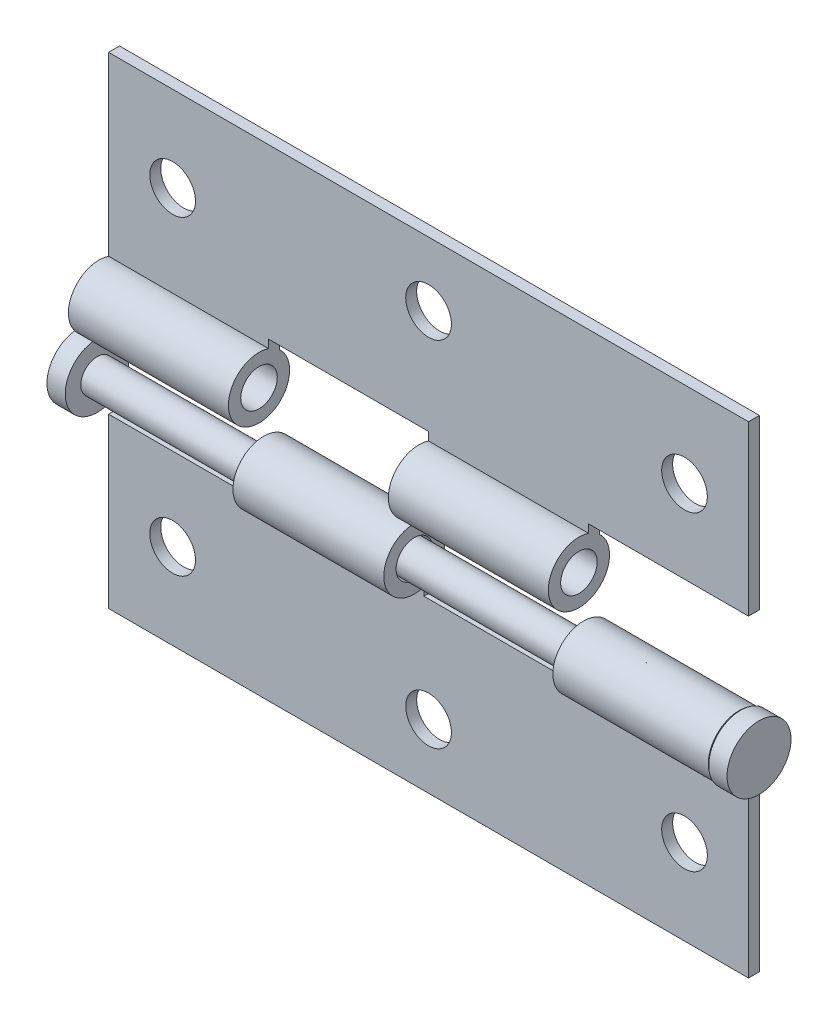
ISO-10303-21;
HEADER;
FILE_DESCRIPTION(('STEP AP214'),'2;1');
FILE_NAME('part.step','',(''),(''),'','','');
FILE_SCHEMA(('AUTOMOTIVE_DESIGN { 1 0 10303 214 1 1 1 1 }'));
ENDSEC;
DATA;
#1=APPLICATION_CONTEXT('core data for automotive mechanical design processes');
#2=APPLICATION_PROTOCOL_DEFINITION('international standard','automotive_design',2000,#1);
#3=PRODUCT_CONTEXT('',#1,'mechanical');
#4=PRODUCT('Part','Part','',(#3));
#5=PRODUCT_RELATED_PRODUCT_CATEGORY('part','',(#4));
#6=PRODUCT_DEFINITION_FORMATION('','',#4);
#7=PRODUCT_DEFINITION_CONTEXT('part definition',#1,'design');
#8=PRODUCT_DEFINITION('design','',#6,#7);
#9=PRODUCT_DEFINITION_SHAPE('','',#8);
#10=(LENGTH_UNIT() NAMED_UNIT(*) SI_UNIT(.MILLI.,.METRE.));
#11=(NAMED_UNIT(*) PLANE_ANGLE_UNIT() SI_UNIT($,.RADIAN.));
#12=(NAMED_UNIT(*) SI_UNIT($,.STERADIAN.) SOLID_ANGLE_UNIT());
#13=UNCERTAINTY_MEASURE_WITH_UNIT(LENGTH_MEASURE(1.E-05),#10,'distance_accuracy_value','');
#14=(GEOMETRIC_REPRESENTATION_CONTEXT(3) GLOBAL_UNCERTAINTY_ASSIGNED_CONTEXT((#13)) GLOBAL_UNIT_ASSIGNED_CONTEXT((#10,
#11,#12)) REPRESENTATION_CONTEXT('',''));
#15=CARTESIAN_POINT('',(0.,0.,0.));
#16=DIRECTION('',(0.,0.,1.));
#17=DIRECTION('',(1.,0.,0.));
#18=AXIS2_PLACEMENT_3D('',#15,#16,#17);
#19=CARTESIAN_POINT('',(35.,3.85,2.25));
#20=DIRECTION('',(-1.,0.,0.));
#21=DIRECTION('',(0.,0.,1.));
#22=AXIS2_PLACEMENT_3D('',#19,#20,#21);
#23=CYLINDRICAL_SURFACE('',#22,3.35);
#24=DIRECTION('',(-1.,0.,0.));
#25=VECTOR('',#24,1.);
#26=CARTESIAN_POINT('',(35.,7.03119474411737,1.2));
#27=LINE('',#26,#25);
#28=CARTESIAN_POINT('',(17.5,7.03119474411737,1.2));
#29=VERTEX_POINT('',#28);
#30=CARTESIAN_POINT('',(0.,7.03119474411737,1.2));
#31=VERTEX_POINT('',#30);
#32=EDGE_CURVE('E192',#29,#31,#27,.T.);
#33=ORIENTED_EDGE('',*,*,#32,.T.);
#34=CARTESIAN_POINT('',(0.,3.85,2.25));
#35=DIRECTION('',(1.,0.,0.));
#36=DIRECTION('',(0.,0.,-1.));
#37=AXIS2_PLACEMENT_3D('',#34,#35,#36);
#38=CIRCLE('',#37,3.35);
#39=CARTESIAN_POINT('',(0.,6.33193472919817,0.));
#40=VERTEX_POINT('',#39);
#41=EDGE_CURVE('E146',#31,#40,#38,.T.);
#42=ORIENTED_EDGE('',*,*,#41,.T.);
#43=DIRECTION('',(-1.,0.,0.));
#44=VECTOR('',#43,1.);
#45=CARTESIAN_POINT('',(35.,6.33193472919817,0.));
#46=LINE('',#45,#44);
#47=CARTESIAN_POINT('',(17.5,6.33193472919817,0.));
#48=VERTEX_POINT('',#47);
#49=EDGE_CURVE('E196',#48,#40,#46,.T.);
#50=ORIENTED_EDGE('',*,*,#49,.F.);
#51=CARTESIAN_POINT('',(17.5,3.85,2.25));
#52=DIRECTION('',(-1.,0.,0.));
#53=DIRECTION('',(0.,-1.,0.));
#54=AXIS2_PLACEMENT_3D('',#51,#52,#53);
#55=CIRCLE('',#54,3.35);
#56=EDGE_CURVE('E156',#48,#29,#55,.T.);
#57=ORIENTED_EDGE('',*,*,#56,.T.);
#58=EDGE_LOOP('',(#33,#42,#50,#57));
#59=FACE_BOUND('',#58,.T.);
#60=ADVANCED_FACE('F47',(#59),#23,.T.);
#61=CARTESIAN_POINT('',(35.,3.85,2.25));
#62=DIRECTION('',(-1.,0.,0.));
#63=DIRECTION('',(0.,0.,1.));
#64=AXIS2_PLACEMENT_3D('',#61,#62,#63);
#65=CYLINDRICAL_SURFACE('',#64,2.);
#66=CARTESIAN_POINT('',(0.,3.85,2.25));
#67=DIRECTION('',(1.,0.,0.));
#68=DIRECTION('',(0.,0.,-1.));
#69=AXIS2_PLACEMENT_3D('',#66,#67,#68);
#70=CIRCLE('',#69,2.);
#71=CARTESIAN_POINT('',(0.,3.85,0.249999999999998));
#72=VERTEX_POINT('',#71);
#73=EDGE_CURVE('E134',#72,#72,#70,.T.);
#74=ORIENTED_EDGE('',*,*,#73,.F.);
#75=EDGE_LOOP('',(#74));
#76=FACE_BOUND('',#75,.T.);
#77=CARTESIAN_POINT('',(17.5,3.85,2.25));
#78=DIRECTION('',(-1.,0.,0.));
#79=DIRECTION('',(0.,-1.,0.));
#80=AXIS2_PLACEMENT_3D('',#77,#78,#79);
#81=CIRCLE('',#80,2.);
#82=CARTESIAN_POINT('',(17.5,1.85,2.25));
#83=VERTEX_POINT('',#82);
#84=EDGE_CURVE('E151',#83,#83,#81,.T.);
#85=ORIENTED_EDGE('',*,*,#84,.F.);
#86=EDGE_LOOP('',(#85));
#87=FACE_BOUND('',#86,.T.);
#88=ADVANCED_FACE('F284',(#76,#87),#65,.F.);
#89=CARTESIAN_POINT('',(35.,3.85,2.25));
#90=DIRECTION('',(1.,0.,0.));
#91=DIRECTION('',(0.,0.,-1.));
#92=AXIS2_PLACEMENT_3D('',#89,#90,#91);
#93=PLANE('',#92);
#94=DIRECTION('',(0.,0.,1.));
#95=VECTOR('',#94,1.);
#96=CARTESIAN_POINT('',(35.,7.93119474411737,-1.25));
#97=LINE('',#96,#95);
#98=CARTESIAN_POINT('',(35.,7.93119474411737,0.));
#99=VERTEX_POINT('',#98);
#100=CARTESIAN_POINT('',(35.,7.93119474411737,1.2));
#101=VERTEX_POINT('',#100);
#102=EDGE_CURVE('E70',#99,#101,#97,.T.);
#103=ORIENTED_EDGE('',*,*,#102,.F.);
#104=DIRECTION('',(0.,-1.,0.));
#105=VECTOR('',#104,1.);
#106=CARTESIAN_POINT('',(35.,6.33193472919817,0.));
#107=LINE('',#106,#105);
#108=CARTESIAN_POINT('',(35.,26.35,0.));
#109=VERTEX_POINT('',#108);
#110=EDGE_CURVE('E168',#109,#99,#107,.T.);
#111=ORIENTED_EDGE('',*,*,#110,.F.);
#112=DIRECTION('',(0.,0.,-1.));
#113=VECTOR('',#112,1.);
#114=CARTESIAN_POINT('',(35.,26.35,1.2));
#115=LINE('',#114,#113);
#116=CARTESIAN_POINT('',(35.,26.35,1.2));
#117=VERTEX_POINT('',#116);
#118=EDGE_CURVE('E174',#117,#109,#115,.T.);
#119=ORIENTED_EDGE('',*,*,#118,.F.);
#120=DIRECTION('',(0.,1.,0.));
#121=VECTOR('',#120,1.);
#122=CARTESIAN_POINT('',(35.,7.03119474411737,1.2));
#123=LINE('',#122,#121);
#124=EDGE_CURVE('E171',#101,#117,#123,.T.);
#125=ORIENTED_EDGE('',*,*,#124,.F.);
#126=EDGE_LOOP('',(#103,#111,#119,#125));
#127=FACE_BOUND('',#126,.T.);
#128=ADVANCED_FACE('F262',(#127),#93,.T.);
#129=CARTESIAN_POINT('',(-35.,3.85,2.25));
#130=DIRECTION('',(1.,0.,0.));
#131=DIRECTION('',(0.,0.,-1.));
#132=AXIS2_PLACEMENT_3D('',#129,#130,#131);
#133=PLANE('',#132);
#134=DIRECTION('',(0.,-1.,0.));
#135=VECTOR('',#134,1.);
#136=CARTESIAN_POINT('',(-35.,6.33193472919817,0.));
#137=LINE('',#136,#135);
#138=CARTESIAN_POINT('',(-35.,26.35,0.));
#139=VERTEX_POINT('',#138);
#140=CARTESIAN_POINT('',(-35.,6.33193472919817,0.));
#141=VERTEX_POINT('',#140);
#142=EDGE_CURVE('E167',#139,#141,#137,.T.);
#143=ORIENTED_EDGE('',*,*,#142,.T.);
#144=CARTESIAN_POINT('',(-35.,3.85,2.25));
#145=DIRECTION('',(-1.,0.,0.));
#146=DIRECTION('',(0.,0.,-1.));
#147=AXIS2_PLACEMENT_3D('',#144,#145,#146);
#148=CIRCLE('',#147,3.35);
#149=CARTESIAN_POINT('',(-35.,7.03119474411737,1.2));
#150=VERTEX_POINT('',#149);
#151=EDGE_CURVE('E180',#141,#150,#148,.T.);
#152=ORIENTED_EDGE('',*,*,#151,.T.);
#153=DIRECTION('',(0.,1.,0.));
#154=VECTOR('',#153,1.);
#155=CARTESIAN_POINT('',(-35.,7.03119474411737,1.2));
#156=LINE('',#155,#154);
#157=CARTESIAN_POINT('',(-35.,26.35,1.2));
#158=VERTEX_POINT('',#157);
#159=EDGE_CURVE('E183',#150,#158,#156,.T.);
#160=ORIENTED_EDGE('',*,*,#159,.T.);
#161=DIRECTION('',(0.,0.,-1.));
#162=VECTOR('',#161,1.);
#163=CARTESIAN_POINT('',(-35.,26.35,1.2));
#164=LINE('',#163,#162);
#165=EDGE_CURVE('E172',#158,#139,#164,.T.);
#166=ORIENTED_EDGE('',*,*,#165,.T.);
#167=EDGE_LOOP('',(#143,#152,#160,#166));
#168=FACE_BOUND('',#167,.T.);
#169=CARTESIAN_POINT('',(-35.,3.85,2.25));
#170=DIRECTION('',(-1.,0.,0.));
#171=DIRECTION('',(0.,0.,-1.));
#172=AXIS2_PLACEMENT_3D('',#169,#170,#171);
#173=CIRCLE('',#172,2.);
#174=CARTESIAN_POINT('',(-35.,3.85,0.249999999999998));
#175=VERTEX_POINT('',#174);
#176=EDGE_CURVE('E164',#175,#175,#173,.T.);
#177=ORIENTED_EDGE('',*,*,#176,.F.);
#178=EDGE_LOOP('',(#177));
#179=FACE_BOUND('',#178,.T.);
#180=ADVANCED_FACE('F253',(#168,#179),#133,.F.);
#181=CARTESIAN_POINT('',(35.,6.33193472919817,0.));
#182=DIRECTION('',(0.,0.,1.));
#183=DIRECTION('',(1.,0.,0.));
#184=AXIS2_PLACEMENT_3D('',#181,#182,#183);
#185=PLANE('',#184);
#186=CARTESIAN_POINT('',(0.,19.35,0.));
#187=DIRECTION('',(0.,0.,1.));
#188=DIRECTION('',(1.,0.,0.));
#189=AXIS2_PLACEMENT_3D('',#186,#187,#188);
#190=CIRCLE('',#189,2.5);
#191=CARTESIAN_POINT('',(2.5,19.35,0.));
#192=VERTEX_POINT('',#191);
#193=EDGE_CURVE('E215',#192,#192,#190,.T.);
#194=ORIENTED_EDGE('',*,*,#193,.T.);
#195=EDGE_LOOP('',(#194));
#196=FACE_BOUND('',#195,.T.);
#197=CARTESIAN_POINT('',(28.,17.,0.));
#198=DIRECTION('',(0.,0.,1.));
#199=DIRECTION('',(1.,0.,0.));
#200=AXIS2_PLACEMENT_3D('',#197,#198,#199);
#201=CIRCLE('',#200,2.5);
#202=CARTESIAN_POINT('',(30.5,17.,0.));
#203=VERTEX_POINT('',#202);
#204=EDGE_CURVE('E219',#203,#203,#201,.T.);
#205=ORIENTED_EDGE('',*,*,#204,.T.);
#206=EDGE_LOOP('',(#205));
#207=FACE_BOUND('',#206,.T.);
#208=CARTESIAN_POINT('',(-28.,17.,0.));
#209=DIRECTION('',(0.,0.,1.));
#210=DIRECTION('',(1.,0.,0.));
#211=AXIS2_PLACEMENT_3D('',#208,#209,#210);
#212=CIRCLE('',#211,2.5);
#213=CARTESIAN_POINT('',(-25.5,17.,0.));
#214=VERTEX_POINT('',#213);
#215=EDGE_CURVE('E222',#214,#214,#212,.T.);
#216=ORIENTED_EDGE('',*,*,#215,.T.);
#217=EDGE_LOOP('',(#216));
#218=FACE_BOUND('',#217,.T.);
#219=ORIENTED_EDGE('',*,*,#49,.T.);
#220=DIRECTION('',(0.,1.,0.));
#221=VECTOR('',#220,1.);
#222=CARTESIAN_POINT('',(0.,6.33193472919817,0.));
#223=LINE('',#222,#221);
#224=CARTESIAN_POINT('',(0.,7.93119474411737,0.));
#225=VERTEX_POINT('',#224);
#226=EDGE_CURVE('E142',#40,#225,#223,.T.);
#227=ORIENTED_EDGE('',*,*,#226,.T.);
#228=DIRECTION('',(-1.,0.,0.));
#229=VECTOR('',#228,1.);
#230=CARTESIAN_POINT('',(35.,7.93119474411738,0.));
#231=LINE('',#230,#229);
#232=CARTESIAN_POINT('',(-17.5,7.93119474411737,0.));
#233=VERTEX_POINT('',#232);
#234=EDGE_CURVE('E137',#225,#233,#231,.T.);
#235=ORIENTED_EDGE('',*,*,#234,.T.);
#236=DIRECTION('',(0.,-1.,0.));
#237=VECTOR('',#236,1.);
#238=CARTESIAN_POINT('',(-17.5,6.33193472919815,0.));
#239=LINE('',#238,#237);
#240=CARTESIAN_POINT('',(-17.5,6.33193472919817,0.));
#241=VERTEX_POINT('',#240);
#242=EDGE_CURVE('E124',#233,#241,#239,.T.);
#243=ORIENTED_EDGE('',*,*,#242,.T.);
#244=EDGE_CURVE('E195',#241,#141,#46,.T.);
#245=ORIENTED_EDGE('',*,*,#244,.T.);
#246=ORIENTED_EDGE('',*,*,#142,.F.);
#247=DIRECTION('',(-1.,0.,0.));
#248=VECTOR('',#247,1.);
#249=CARTESIAN_POINT('',(35.,26.35,0.));
#250=LINE('',#249,#248);
#251=EDGE_CURVE('E177',#109,#139,#250,.T.);
#252=ORIENTED_EDGE('',*,*,#251,.F.);
#253=ORIENTED_EDGE('',*,*,#110,.T.);
#254=DIRECTION('',(-1.,0.,0.));
#255=VECTOR('',#254,1.);
#256=CARTESIAN_POINT('',(35.,7.93119474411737,0.));
#257=LINE('',#256,#255);
#258=CARTESIAN_POINT('',(17.5,7.93119474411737,0.));
#259=VERTEX_POINT('',#258);
#260=EDGE_CURVE('E161',#99,#259,#257,.T.);
#261=ORIENTED_EDGE('',*,*,#260,.T.);
#262=DIRECTION('',(0.,-1.,0.));
#263=VECTOR('',#262,1.);
#264=CARTESIAN_POINT('',(17.5,6.33193472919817,0.));
#265=LINE('',#264,#263);
#266=EDGE_CURVE('E158',#259,#48,#265,.T.);
#267=ORIENTED_EDGE('',*,*,#266,.T.);
#268=EDGE_LOOP('',(#219,#227,#235,#243,#245,#246,#252,#253,#261,#267));
#269=FACE_BOUND('',#268,.T.);
#270=ADVANCED_FACE('F49',(#196,#207,#218,#269),#185,.F.);
#271=CARTESIAN_POINT('',(-17.5,3.85,2.25));
#272=DIRECTION('',(-1.,0.,0.));
#273=DIRECTION('',(0.,-1.,0.));
#274=AXIS2_PLACEMENT_3D('',#271,#272,#273);
#275=CIRCLE('',#274,3.35);
#276=CARTESIAN_POINT('',(-17.5,7.03119474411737,1.2));
#277=VERTEX_POINT('',#276);
#278=EDGE_CURVE('E130',#241,#277,#275,.T.);
#279=ORIENTED_EDGE('',*,*,#278,.T.);
#280=EDGE_CURVE('E191',#277,#150,#27,.T.);
#281=ORIENTED_EDGE('',*,*,#280,.T.);
#282=ORIENTED_EDGE('',*,*,#151,.F.);
#283=ORIENTED_EDGE('',*,*,#244,.F.);
#284=EDGE_LOOP('',(#279,#281,#282,#283));
#285=FACE_BOUND('',#284,.T.);
#286=ADVANCED_FACE('F242',(#285),#23,.T.);
#287=CARTESIAN_POINT('',(35.,7.03119474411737,1.2));
#288=DIRECTION('',(0.,0.,-1.));
#289=DIRECTION('',(0.,-1.,0.));
#290=AXIS2_PLACEMENT_3D('',#287,#288,#289);
#291=PLANE('',#290);
#292=CARTESIAN_POINT('',(0.,19.35,1.2));
#293=DIRECTION('',(0.,0.,1.));
#294=DIRECTION('',(-1.,0.,0.));
#295=AXIS2_PLACEMENT_3D('',#292,#293,#294);
#296=CIRCLE('',#295,2.5);
#297=CARTESIAN_POINT('',(-2.5,19.35,1.2));
#298=VERTEX_POINT('',#297);
#299=EDGE_CURVE('E225',#298,#298,#296,.T.);
#300=ORIENTED_EDGE('',*,*,#299,.F.);
#301=EDGE_LOOP('',(#300));
#302=FACE_BOUND('',#301,.T.);
#303=CARTESIAN_POINT('',(28.,17.,1.2));
#304=DIRECTION('',(0.,0.,1.));
#305=DIRECTION('',(1.,0.,0.));
#306=AXIS2_PLACEMENT_3D('',#303,#304,#305);
#307=CIRCLE('',#306,2.5);
#308=CARTESIAN_POINT('',(30.5,17.,1.2));
#309=VERTEX_POINT('',#308);
#310=EDGE_CURVE('E229',#309,#309,#307,.T.);
#311=ORIENTED_EDGE('',*,*,#310,.F.);
#312=EDGE_LOOP('',(#311));
#313=FACE_BOUND('',#312,.T.);
#314=CARTESIAN_POINT('',(-28.,17.,1.2));
#315=DIRECTION('',(0.,0.,1.));
#316=DIRECTION('',(-1.,0.,0.));
#317=AXIS2_PLACEMENT_3D('',#314,#315,#316);
#318=CIRCLE('',#317,2.5);
#319=CARTESIAN_POINT('',(-30.5,17.,1.2));
#320=VERTEX_POINT('',#319);
#321=EDGE_CURVE('E226',#320,#320,#318,.T.);
#322=ORIENTED_EDGE('',*,*,#321,.F.);
#323=EDGE_LOOP('',(#322));
#324=FACE_BOUND('',#323,.T.);
#325=DIRECTION('',(1.,0.,0.));
#326=VECTOR('',#325,1.);
#327=CARTESIAN_POINT('',(35.,7.93119474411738,1.2));
#328=LINE('',#327,#326);
#329=CARTESIAN_POINT('',(-17.5,7.93119474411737,1.2));
#330=VERTEX_POINT('',#329);
#331=CARTESIAN_POINT('',(0.,7.93119474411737,1.2));
#332=VERTEX_POINT('',#331);
#333=EDGE_CURVE('E13',#330,#332,#328,.T.);
#334=ORIENTED_EDGE('',*,*,#333,.T.);
#335=DIRECTION('',(0.,-1.,0.));
#336=VECTOR('',#335,1.);
#337=CARTESIAN_POINT('',(0.,7.03119474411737,1.2));
#338=LINE('',#337,#336);
#339=EDGE_CURVE('E204',#332,#31,#338,.T.);
#340=ORIENTED_EDGE('',*,*,#339,.T.);
#341=ORIENTED_EDGE('',*,*,#32,.F.);
#342=DIRECTION('',(0.,1.,0.));
#343=VECTOR('',#342,1.);
#344=CARTESIAN_POINT('',(17.5,7.03119474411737,1.2));
#345=LINE('',#344,#343);
#346=CARTESIAN_POINT('',(17.5,7.93119474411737,1.2));
#347=VERTEX_POINT('',#346);
#348=EDGE_CURVE('E153',#29,#347,#345,.T.);
#349=ORIENTED_EDGE('',*,*,#348,.T.);
#350=DIRECTION('',(1.,0.,0.));
#351=VECTOR('',#350,1.);
#352=CARTESIAN_POINT('',(35.,7.93119474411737,1.2));
#353=LINE('',#352,#351);
#354=EDGE_CURVE('E55',#347,#101,#353,.T.);
#355=ORIENTED_EDGE('',*,*,#354,.T.);
#356=ORIENTED_EDGE('',*,*,#124,.T.);
#357=DIRECTION('',(-1.,0.,0.));
#358=VECTOR('',#357,1.);
#359=CARTESIAN_POINT('',(35.,26.35,1.2));
#360=LINE('',#359,#358);
#361=EDGE_CURVE('E189',#117,#158,#360,.T.);
#362=ORIENTED_EDGE('',*,*,#361,.T.);
#363=ORIENTED_EDGE('',*,*,#159,.F.);
#364=ORIENTED_EDGE('',*,*,#280,.F.);
#365=DIRECTION('',(0.,1.,0.));
#366=VECTOR('',#365,1.);
#367=CARTESIAN_POINT('',(-17.5,7.03119474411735,1.2));
#368=LINE('',#367,#366);
#369=EDGE_CURVE('E202',#277,#330,#368,.T.);
#370=ORIENTED_EDGE('',*,*,#369,.T.);
#371=EDGE_LOOP('',(#334,#340,#341,#349,#355,#356,#362,#363,#364,#370));
#372=FACE_BOUND('',#371,.T.);
#373=ADVANCED_FACE('F238',(#302,#313,#324,#372),#291,.F.);
#374=CARTESIAN_POINT('',(35.,26.35,1.2));
#375=DIRECTION('',(0.,-1.,0.));
#376=DIRECTION('',(0.,0.,1.));
#377=AXIS2_PLACEMENT_3D('',#374,#375,#376);
#378=PLANE('',#377);
#379=ORIENTED_EDGE('',*,*,#165,.F.);
#380=ORIENTED_EDGE('',*,*,#361,.F.);
#381=ORIENTED_EDGE('',*,*,#118,.T.);
#382=ORIENTED_EDGE('',*,*,#251,.T.);
#383=EDGE_LOOP('',(#379,#380,#381,#382));
#384=FACE_BOUND('',#383,.T.);
#385=ADVANCED_FACE('F241',(#384),#378,.F.);
#386=CARTESIAN_POINT('',(-17.5,3.85,2.25));
#387=DIRECTION('',(-1.,0.,0.));
#388=DIRECTION('',(0.,-1.,0.));
#389=AXIS2_PLACEMENT_3D('',#386,#387,#388);
#390=CIRCLE('',#389,2.);
#391=CARTESIAN_POINT('',(-17.5,1.85,2.25));
#392=VERTEX_POINT('',#391);
#393=EDGE_CURVE('E138',#392,#392,#390,.T.);
#394=ORIENTED_EDGE('',*,*,#393,.F.);
#395=EDGE_LOOP('',(#394));
#396=FACE_BOUND('',#395,.T.);
#397=ORIENTED_EDGE('',*,*,#176,.T.);
#398=EDGE_LOOP('',(#397));
#399=FACE_BOUND('',#398,.T.);
#400=ADVANCED_FACE('F290',(#396,#399),#65,.F.);
#401=CARTESIAN_POINT('',(35.,7.93119474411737,-1.25));
#402=DIRECTION('',(0.,1.,0.));
#403=DIRECTION('',(-1.,0.,0.));
#404=AXIS2_PLACEMENT_3D('',#401,#402,#403);
#405=PLANE('',#404);
#406=ORIENTED_EDGE('',*,*,#102,.T.);
#407=ORIENTED_EDGE('',*,*,#354,.F.);
#408=DIRECTION('',(0.,0.,1.));
#409=VECTOR('',#408,1.);
#410=CARTESIAN_POINT('',(17.5,7.93119474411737,-1.25));
#411=LINE('',#410,#409);
#412=EDGE_CURVE('E144',#259,#347,#411,.T.);
#413=ORIENTED_EDGE('',*,*,#412,.F.);
#414=ORIENTED_EDGE('',*,*,#260,.F.);
#415=EDGE_LOOP('',(#406,#407,#413,#414));
#416=FACE_BOUND('',#415,.T.);
#417=ADVANCED_FACE('F265',(#416),#405,.F.);
#418=CARTESIAN_POINT('',(17.5,7.93119474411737,-1.25));
#419=DIRECTION('',(-1.,0.,0.));
#420=DIRECTION('',(0.,-1.,0.));
#421=AXIS2_PLACEMENT_3D('',#418,#419,#420);
#422=PLANE('',#421);
#423=ORIENTED_EDGE('',*,*,#84,.T.);
#424=EDGE_LOOP('',(#423));
#425=FACE_BOUND('',#424,.T.);
#426=ORIENTED_EDGE('',*,*,#412,.T.);
#427=ORIENTED_EDGE('',*,*,#348,.F.);
#428=ORIENTED_EDGE('',*,*,#56,.F.);
#429=ORIENTED_EDGE('',*,*,#266,.F.);
#430=EDGE_LOOP('',(#426,#427,#428,#429));
#431=FACE_BOUND('',#430,.T.);
#432=ADVANCED_FACE('F268',(#425,#431),#422,.F.);
#433=CARTESIAN_POINT('',(0.,7.93119474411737,-1.25));
#434=DIRECTION('',(0.,1.,0.));
#435=DIRECTION('',(-1.,0.,0.));
#436=AXIS2_PLACEMENT_3D('',#433,#434,#435);
#437=PLANE('',#436);
#438=DIRECTION('',(0.,0.,1.));
#439=VECTOR('',#438,1.);
#440=CARTESIAN_POINT('',(0.,7.93119474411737,-1.25));
#441=LINE('',#440,#439);
#442=EDGE_CURVE('E62',#225,#332,#441,.T.);
#443=ORIENTED_EDGE('',*,*,#442,.T.);
#444=ORIENTED_EDGE('',*,*,#333,.F.);
#445=DIRECTION('',(0.,0.,1.));
#446=VECTOR('',#445,1.);
#447=CARTESIAN_POINT('',(-17.5,7.93119474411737,-1.25));
#448=LINE('',#447,#446);
#449=EDGE_CURVE('E128',#233,#330,#448,.T.);
#450=ORIENTED_EDGE('',*,*,#449,.F.);
#451=ORIENTED_EDGE('',*,*,#234,.F.);
#452=EDGE_LOOP('',(#443,#444,#450,#451));
#453=FACE_BOUND('',#452,.T.);
#454=ADVANCED_FACE('F136',(#453),#437,.F.);
#455=CARTESIAN_POINT('',(0.,7.93119474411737,-1.25));
#456=DIRECTION('',(1.,0.,0.));
#457=DIRECTION('',(0.,0.,-1.));
#458=AXIS2_PLACEMENT_3D('',#455,#456,#457);
#459=PLANE('',#458);
#460=ORIENTED_EDGE('',*,*,#73,.T.);
#461=EDGE_LOOP('',(#460));
#462=FACE_BOUND('',#461,.T.);
#463=ORIENTED_EDGE('',*,*,#41,.F.);
#464=ORIENTED_EDGE('',*,*,#339,.F.);
#465=ORIENTED_EDGE('',*,*,#442,.F.);
#466=ORIENTED_EDGE('',*,*,#226,.F.);
#467=EDGE_LOOP('',(#463,#464,#465,#466));
#468=FACE_BOUND('',#467,.T.);
#469=ADVANCED_FACE('F271',(#462,#468),#459,.F.);
#470=CARTESIAN_POINT('',(-17.5,7.93119474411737,-1.25));
#471=DIRECTION('',(-1.,0.,0.));
#472=DIRECTION('',(0.,-1.,0.));
#473=AXIS2_PLACEMENT_3D('',#470,#471,#472);
#474=PLANE('',#473);
#475=ORIENTED_EDGE('',*,*,#393,.T.);
#476=EDGE_LOOP('',(#475));
#477=FACE_BOUND('',#476,.T.);
#478=ORIENTED_EDGE('',*,*,#449,.T.);
#479=ORIENTED_EDGE('',*,*,#369,.F.);
#480=ORIENTED_EDGE('',*,*,#278,.F.);
#481=ORIENTED_EDGE('',*,*,#242,.F.);
#482=EDGE_LOOP('',(#478,#479,#480,#481));
#483=FACE_BOUND('',#482,.T.);
#484=ADVANCED_FACE('F126',(#477,#483),#474,.F.);
#485=CARTESIAN_POINT('',(-28.,17.,-1.25));
#486=DIRECTION('',(0.,0.,1.));
#487=DIRECTION('',(1.,0.,0.));
#488=AXIS2_PLACEMENT_3D('',#485,#486,#487);
#489=CYLINDRICAL_SURFACE('',#488,2.5);
#490=ORIENTED_EDGE('',*,*,#321,.T.);
#491=EDGE_LOOP('',(#490));
#492=FACE_BOUND('',#491,.T.);
#493=ORIENTED_EDGE('',*,*,#215,.F.);
#494=EDGE_LOOP('',(#493));
#495=FACE_BOUND('',#494,.T.);
#496=ADVANCED_FACE('F278',(#492,#495),#489,.F.);
#497=CARTESIAN_POINT('',(28.,17.,-1.25));
#498=DIRECTION('',(0.,0.,1.));
#499=DIRECTION('',(1.,0.,0.));
#500=AXIS2_PLACEMENT_3D('',#497,#498,#499);
#501=CYLINDRICAL_SURFACE('',#500,2.5);
#502=ORIENTED_EDGE('',*,*,#310,.T.);
#503=EDGE_LOOP('',(#502));
#504=FACE_BOUND('',#503,.T.);
#505=ORIENTED_EDGE('',*,*,#204,.F.);
#506=EDGE_LOOP('',(#505));
#507=FACE_BOUND('',#506,.T.);
#508=ADVANCED_FACE('F307',(#504,#507),#501,.F.);
#509=CARTESIAN_POINT('',(0.,19.35,-1.25));
#510=DIRECTION('',(0.,0.,1.));
#511=DIRECTION('',(1.,0.,0.));
#512=AXIS2_PLACEMENT_3D('',#509,#510,#511);
#513=CYLINDRICAL_SURFACE('',#512,2.5);
#514=ORIENTED_EDGE('',*,*,#299,.T.);
#515=EDGE_LOOP('',(#514));
#516=FACE_BOUND('',#515,.T.);
#517=ORIENTED_EDGE('',*,*,#193,.F.);
#518=EDGE_LOOP('',(#517));
#519=FACE_BOUND('',#518,.T.);
#520=ADVANCED_FACE('F235',(#516,#519),#513,.F.);
#521=CLOSED_SHELL('',(#60,#88,#128,#180,#270,#286,#373,#385,#400,#417,#432,#454,#469,#484,#496,
#508,#520));
#522=MANIFOLD_SOLID_BREP('B2',#521);
#523=CARTESIAN_POINT('',(35.,-3.85,2.25));
#524=DIRECTION('',(-1.,0.,0.));
#525=DIRECTION('',(0.,0.,1.));
#526=AXIS2_PLACEMENT_3D('',#523,#524,#525);
#527=CYLINDRICAL_SURFACE('',#526,3.35);
#528=CARTESIAN_POINT('',(-17.,-3.85,2.25));
#529=DIRECTION('',(1.,0.,0.));
#530=DIRECTION('',(0.,1.,0.));
#531=AXIS2_PLACEMENT_3D('',#528,#529,#530);
#532=CIRCLE('',#531,3.35);
#533=CARTESIAN_POINT('',(-17.,-6.33193472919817,0.));
#534=VERTEX_POINT('',#533);
#535=CARTESIAN_POINT('',(-17.,-7.03119474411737,1.2));
#536=VERTEX_POINT('',#535);
#537=EDGE_CURVE('E518',#534,#536,#532,.T.);
#538=ORIENTED_EDGE('',*,*,#537,.T.);
#539=DIRECTION('',(-1.,0.,0.));
#540=VECTOR('',#539,1.);
#541=CARTESIAN_POINT('',(35.,-7.03119474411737,1.2));
#542=LINE('',#541,#540);
#543=CARTESIAN_POINT('',(-0.499999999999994,-7.03119474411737,1.2));
#544=VERTEX_POINT('',#543);
#545=EDGE_CURVE('E587',#544,#536,#542,.T.);
#546=ORIENTED_EDGE('',*,*,#545,.F.);
#547=CARTESIAN_POINT('',(-0.499999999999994,-3.85,2.25));
#548=DIRECTION('',(-1.,0.,0.));
#549=DIRECTION('',(0.,-1.,0.));
#550=AXIS2_PLACEMENT_3D('',#547,#548,#549);
#551=CIRCLE('',#550,3.35);
#552=CARTESIAN_POINT('',(-0.499999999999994,-6.33193472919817,0.));
#553=VERTEX_POINT('',#552);
#554=EDGE_CURVE('E556',#544,#553,#551,.T.);
#555=ORIENTED_EDGE('',*,*,#554,.T.);
#556=DIRECTION('',(-1.,0.,0.));
#557=VECTOR('',#556,1.);
#558=CARTESIAN_POINT('',(35.,-6.33193472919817,0.));
#559=LINE('',#558,#557);
#560=EDGE_CURVE('E591',#553,#534,#559,.T.);
#561=ORIENTED_EDGE('',*,*,#560,.T.);
#562=EDGE_LOOP('',(#538,#546,#555,#561));
#563=FACE_BOUND('',#562,.T.);
#564=ADVANCED_FACE('F436',(#563),#527,.T.);
#565=CARTESIAN_POINT('',(35.,-3.85,2.25));
#566=DIRECTION('',(-1.,0.,0.));
#567=DIRECTION('',(0.,0.,1.));
#568=AXIS2_PLACEMENT_3D('',#565,#566,#567);
#569=CYLINDRICAL_SURFACE('',#568,2.);
#570=CARTESIAN_POINT('',(-17.,-3.85,2.25));
#571=DIRECTION('',(1.,0.,0.));
#572=DIRECTION('',(0.,1.,0.));
#573=AXIS2_PLACEMENT_3D('',#570,#571,#572);
#574=CIRCLE('',#573,2.);
#575=CARTESIAN_POINT('',(-17.,-1.85,2.25));
#576=VERTEX_POINT('',#575);
#577=EDGE_CURVE('E523',#576,#576,#574,.T.);
#578=ORIENTED_EDGE('',*,*,#577,.F.);
#579=EDGE_LOOP('',(#578));
#580=FACE_BOUND('',#579,.T.);
#581=CARTESIAN_POINT('',(-0.499999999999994,-3.85,2.25));
#582=DIRECTION('',(-1.,0.,0.));
#583=DIRECTION('',(0.,-1.,0.));
#584=AXIS2_PLACEMENT_3D('',#581,#582,#583);
#585=CIRCLE('',#584,2.);
#586=CARTESIAN_POINT('',(-0.499999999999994,-5.85,2.25));
#587=VERTEX_POINT('',#586);
#588=EDGE_CURVE('E552',#587,#587,#585,.T.);
#589=ORIENTED_EDGE('',*,*,#588,.F.);
#590=EDGE_LOOP('',(#589));
#591=FACE_BOUND('',#590,.T.);
#592=ADVANCED_FACE('F632',(#580,#591),#569,.F.);
#593=CARTESIAN_POINT('',(35.,-3.85,2.25));
#594=DIRECTION('',(1.,0.,0.));
#595=DIRECTION('',(0.,0.,-1.));
#596=AXIS2_PLACEMENT_3D('',#593,#594,#595);
#597=PLANE('',#596);
#598=DIRECTION('',(0.,1.,0.));
#599=VECTOR('',#598,1.);
#600=CARTESIAN_POINT('',(35.,-6.33193472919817,0.));
#601=LINE('',#600,#599);
#602=CARTESIAN_POINT('',(35.,-26.35,0.));
#603=VERTEX_POINT('',#602);
#604=CARTESIAN_POINT('',(35.,-6.33193472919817,0.));
#605=VERTEX_POINT('',#604);
#606=EDGE_CURVE('E568',#603,#605,#601,.T.);
#607=ORIENTED_EDGE('',*,*,#606,.T.);
#608=CARTESIAN_POINT('',(35.,-3.85,2.25));
#609=DIRECTION('',(1.,0.,0.));
#610=DIRECTION('',(0.,0.,-1.));
#611=AXIS2_PLACEMENT_3D('',#608,#609,#610);
#612=CIRCLE('',#611,3.35);
#613=CARTESIAN_POINT('',(35.,-7.03119474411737,1.2));
#614=VERTEX_POINT('',#613);
#615=EDGE_CURVE('E571',#605,#614,#612,.T.);
#616=ORIENTED_EDGE('',*,*,#615,.T.);
#617=DIRECTION('',(0.,-1.,0.));
#618=VECTOR('',#617,1.);
#619=CARTESIAN_POINT('',(35.,-7.03119474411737,1.2));
#620=LINE('',#619,#618);
#621=CARTESIAN_POINT('',(35.,-26.35,1.2));
#622=VERTEX_POINT('',#621);
#623=EDGE_CURVE('E574',#614,#622,#620,.T.);
#624=ORIENTED_EDGE('',*,*,#623,.T.);
#625=DIRECTION('',(0.,0.,-1.));
#626=VECTOR('',#625,1.);
#627=CARTESIAN_POINT('',(35.,-26.35,1.2));
#628=LINE('',#627,#626);
#629=EDGE_CURVE('E576',#622,#603,#628,.T.);
#630=ORIENTED_EDGE('',*,*,#629,.T.);
#631=EDGE_LOOP('',(#607,#616,#624,#630));
#632=FACE_BOUND('',#631,.T.);
#633=CARTESIAN_POINT('',(35.,-3.85,2.25));
#634=DIRECTION('',(1.,0.,0.));
#635=DIRECTION('',(0.,0.,-1.));
#636=AXIS2_PLACEMENT_3D('',#633,#634,#635);
#637=CIRCLE('',#636,2.);
#638=CARTESIAN_POINT('',(35.,-3.85,0.249999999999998));
#639=VERTEX_POINT('',#638);
#640=EDGE_CURVE('E565',#639,#639,#637,.T.);
#641=ORIENTED_EDGE('',*,*,#640,.F.);
#642=EDGE_LOOP('',(#641));
#643=FACE_BOUND('',#642,.T.);
#644=ADVANCED_FACE('F616',(#632,#643),#597,.T.);
#645=CARTESIAN_POINT('',(-35.,-3.85,2.25));
#646=DIRECTION('',(1.,0.,0.));
#647=DIRECTION('',(0.,0.,-1.));
#648=AXIS2_PLACEMENT_3D('',#645,#646,#647);
#649=PLANE('',#648);
#650=DIRECTION('',(0.,-1.,0.));
#651=VECTOR('',#650,1.);
#652=CARTESIAN_POINT('',(-35.,-7.03119474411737,1.2));
#653=LINE('',#652,#651);
#654=CARTESIAN_POINT('',(-35.,-7.93119474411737,1.2));
#655=VERTEX_POINT('',#654);
#656=CARTESIAN_POINT('',(-35.,-26.35,1.2));
#657=VERTEX_POINT('',#656);
#658=EDGE_CURVE('E580',#655,#657,#653,.T.);
#659=ORIENTED_EDGE('',*,*,#658,.F.);
#660=DIRECTION('',(0.,0.,-1.));
#661=VECTOR('',#660,1.);
#662=CARTESIAN_POINT('',(-35.,-7.93119474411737,2.25));
#663=LINE('',#662,#661);
#664=CARTESIAN_POINT('',(-35.,-7.93119474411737,0.));
#665=VERTEX_POINT('',#664);
#666=EDGE_CURVE('E451',#655,#665,#663,.T.);
#667=ORIENTED_EDGE('',*,*,#666,.T.);
#668=DIRECTION('',(0.,1.,0.));
#669=VECTOR('',#668,1.);
#670=CARTESIAN_POINT('',(-35.,-6.33193472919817,0.));
#671=LINE('',#670,#669);
#672=CARTESIAN_POINT('',(-35.,-26.35,0.));
#673=VERTEX_POINT('',#672);
#674=EDGE_CURVE('E532',#673,#665,#671,.T.);
#675=ORIENTED_EDGE('',*,*,#674,.F.);
#676=DIRECTION('',(0.,0.,-1.));
#677=VECTOR('',#676,1.);
#678=CARTESIAN_POINT('',(-35.,-26.35,1.2));
#679=LINE('',#678,#677);
#680=EDGE_CURVE('E572',#657,#673,#679,.T.);
#681=ORIENTED_EDGE('',*,*,#680,.F.);
#682=EDGE_LOOP('',(#659,#667,#675,#681));
#683=FACE_BOUND('',#682,.T.);
#684=ADVANCED_FACE('F608',(#683),#649,.F.);
#685=CARTESIAN_POINT('',(35.,-6.33193472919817,0.));
#686=DIRECTION('',(0.,0.,1.));
#687=DIRECTION('',(1.,0.,0.));
#688=AXIS2_PLACEMENT_3D('',#685,#686,#687);
#689=PLANE('',#688);
#690=CARTESIAN_POINT('',(-28.,-17.,0.));
#691=DIRECTION('',(0.,0.,1.));
#692=DIRECTION('',(1.,0.,0.));
#693=AXIS2_PLACEMENT_3D('',#690,#691,#692);
#694=CIRCLE('',#693,2.5);
#695=CARTESIAN_POINT('',(-25.5,-17.,0.));
#696=VERTEX_POINT('',#695);
#697=EDGE_CURVE('E527',#696,#696,#694,.T.);
#698=ORIENTED_EDGE('',*,*,#697,.T.);
#699=EDGE_LOOP('',(#698));
#700=FACE_BOUND('',#699,.T.);
#701=CARTESIAN_POINT('',(28.,-17.,0.));
#702=DIRECTION('',(0.,0.,1.));
#703=DIRECTION('',(1.,0.,0.));
#704=AXIS2_PLACEMENT_3D('',#701,#702,#703);
#705=CIRCLE('',#704,2.5);
#706=CARTESIAN_POINT('',(30.5,-17.,0.));
#707=VERTEX_POINT('',#706);
#708=EDGE_CURVE('E657',#707,#707,#705,.T.);
#709=ORIENTED_EDGE('',*,*,#708,.T.);
#710=EDGE_LOOP('',(#709));
#711=FACE_BOUND('',#710,.T.);
#712=CARTESIAN_POINT('',(0.,-19.35,0.));
#713=DIRECTION('',(0.,0.,1.));
#714=DIRECTION('',(1.,0.,0.));
#715=AXIS2_PLACEMENT_3D('',#712,#713,#714);
#716=CIRCLE('',#715,2.5);
#717=CARTESIAN_POINT('',(2.5,-19.35,0.));
#718=VERTEX_POINT('',#717);
#719=EDGE_CURVE('E660',#718,#718,#716,.T.);
#720=ORIENTED_EDGE('',*,*,#719,.T.);
#721=EDGE_LOOP('',(#720));
#722=FACE_BOUND('',#721,.T.);
#723=DIRECTION('',(1.,0.,0.));
#724=VECTOR('',#723,1.);
#725=CARTESIAN_POINT('',(35.,-7.93119474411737,0.));
#726=LINE('',#725,#724);
#727=CARTESIAN_POINT('',(-17.,-7.93119474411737,0.));
#728=VERTEX_POINT('',#727);
#729=EDGE_CURVE('E526',#665,#728,#726,.T.);
#730=ORIENTED_EDGE('',*,*,#729,.T.);
#731=DIRECTION('',(0.,1.,0.));
#732=VECTOR('',#731,1.);
#733=CARTESIAN_POINT('',(-17.,-6.33193472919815,0.));
#734=LINE('',#733,#732);
#735=EDGE_CURVE('E513',#728,#534,#734,.T.);
#736=ORIENTED_EDGE('',*,*,#735,.T.);
#737=ORIENTED_EDGE('',*,*,#560,.F.);
#738=DIRECTION('',(0.,-1.,0.));
#739=VECTOR('',#738,1.);
#740=CARTESIAN_POINT('',(-0.499999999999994,-6.33193472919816,0.));
#741=LINE('',#740,#739);
#742=CARTESIAN_POINT('',(-0.499999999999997,-7.93119474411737,0.));
#743=VERTEX_POINT('',#742);
#744=EDGE_CURVE('E559',#553,#743,#741,.T.);
#745=ORIENTED_EDGE('',*,*,#744,.T.);
#746=DIRECTION('',(1.,0.,0.));
#747=VECTOR('',#746,1.);
#748=CARTESIAN_POINT('',(35.,-7.93119474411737,0.));
#749=LINE('',#748,#747);
#750=CARTESIAN_POINT('',(18.,-7.93119474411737,0.));
#751=VERTEX_POINT('',#750);
#752=EDGE_CURVE('E562',#743,#751,#749,.T.);
#753=ORIENTED_EDGE('',*,*,#752,.T.);
#754=DIRECTION('',(0.,1.,0.));
#755=VECTOR('',#754,1.);
#756=CARTESIAN_POINT('',(18.,-6.33193472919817,0.));
#757=LINE('',#756,#755);
#758=CARTESIAN_POINT('',(18.,-6.33193472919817,0.));
#759=VERTEX_POINT('',#758);
#760=EDGE_CURVE('E549',#751,#759,#757,.T.);
#761=ORIENTED_EDGE('',*,*,#760,.T.);
#762=EDGE_CURVE('E592',#605,#759,#559,.T.);
#763=ORIENTED_EDGE('',*,*,#762,.F.);
#764=ORIENTED_EDGE('',*,*,#606,.F.);
#765=DIRECTION('',(-1.,0.,0.));
#766=VECTOR('',#765,1.);
#767=CARTESIAN_POINT('',(35.,-26.35,0.));
#768=LINE('',#767,#766);
#769=EDGE_CURVE('E578',#603,#673,#768,.T.);
#770=ORIENTED_EDGE('',*,*,#769,.T.);
#771=ORIENTED_EDGE('',*,*,#674,.T.);
#772=EDGE_LOOP('',(#730,#736,#737,#745,#753,#761,#763,#764,#770,#771));
#773=FACE_BOUND('',#772,.T.);
#774=ADVANCED_FACE('F438',(#700,#711,#722,#773),#689,.F.);
#775=CARTESIAN_POINT('',(18.,-3.85,2.25));
#776=DIRECTION('',(1.,0.,0.));
#777=DIRECTION('',(0.,1.,0.));
#778=AXIS2_PLACEMENT_3D('',#775,#776,#777);
#779=CIRCLE('',#778,3.35);
#780=CARTESIAN_POINT('',(18.,-7.03119474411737,1.2));
#781=VERTEX_POINT('',#780);
#782=EDGE_CURVE('E547',#759,#781,#779,.T.);
#783=ORIENTED_EDGE('',*,*,#782,.T.);
#784=EDGE_CURVE('E588',#614,#781,#542,.T.);
#785=ORIENTED_EDGE('',*,*,#784,.F.);
#786=ORIENTED_EDGE('',*,*,#615,.F.);
#787=ORIENTED_EDGE('',*,*,#762,.T.);
#788=EDGE_LOOP('',(#783,#785,#786,#787));
#789=FACE_BOUND('',#788,.T.);
#790=ADVANCED_FACE('F622',(#789),#527,.T.);
#791=CARTESIAN_POINT('',(35.,-7.03119474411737,1.2));
#792=DIRECTION('',(0.,0.,-1.));
#793=DIRECTION('',(0.,1.,0.));
#794=AXIS2_PLACEMENT_3D('',#791,#792,#793);
#795=PLANE('',#794);
#796=CARTESIAN_POINT('',(-28.,-17.,1.2));
#797=DIRECTION('',(0.,0.,1.));
#798=DIRECTION('',(1.,0.,0.));
#799=AXIS2_PLACEMENT_3D('',#796,#797,#798);
#800=CIRCLE('',#799,2.5);
#801=CARTESIAN_POINT('',(-25.5,-17.,1.2));
#802=VERTEX_POINT('',#801);
#803=EDGE_CURVE('E662',#802,#802,#800,.T.);
#804=ORIENTED_EDGE('',*,*,#803,.F.);
#805=EDGE_LOOP('',(#804));
#806=FACE_BOUND('',#805,.T.);
#807=CARTESIAN_POINT('',(28.,-17.,1.2));
#808=DIRECTION('',(0.,0.,1.));
#809=DIRECTION('',(-1.,0.,0.));
#810=AXIS2_PLACEMENT_3D('',#807,#808,#809);
#811=CIRCLE('',#810,2.5);
#812=CARTESIAN_POINT('',(25.5,-17.,1.2));
#813=VERTEX_POINT('',#812);
#814=EDGE_CURVE('E666',#813,#813,#811,.T.);
#815=ORIENTED_EDGE('',*,*,#814,.F.);
#816=EDGE_LOOP('',(#815));
#817=FACE_BOUND('',#816,.T.);
#818=CARTESIAN_POINT('',(0.,-19.35,1.2));
#819=DIRECTION('',(0.,0.,1.));
#820=DIRECTION('',(1.,0.,0.));
#821=AXIS2_PLACEMENT_3D('',#818,#819,#820);
#822=CIRCLE('',#821,2.5);
#823=CARTESIAN_POINT('',(2.5,-19.35,1.2));
#824=VERTEX_POINT('',#823);
#825=EDGE_CURVE('E669',#824,#824,#822,.T.);
#826=ORIENTED_EDGE('',*,*,#825,.F.);
#827=EDGE_LOOP('',(#826));
#828=FACE_BOUND('',#827,.T.);
#829=ORIENTED_EDGE('',*,*,#545,.T.);
#830=DIRECTION('',(0.,-1.,0.));
#831=VECTOR('',#830,1.);
#832=CARTESIAN_POINT('',(-17.,-7.03119474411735,1.2));
#833=LINE('',#832,#831);
#834=CARTESIAN_POINT('',(-17.,-7.93119474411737,1.2));
#835=VERTEX_POINT('',#834);
#836=EDGE_CURVE('E45',#536,#835,#833,.T.);
#837=ORIENTED_EDGE('',*,*,#836,.T.);
#838=DIRECTION('',(-1.,0.,0.));
#839=VECTOR('',#838,1.);
#840=CARTESIAN_POINT('',(35.,-7.93119474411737,1.2));
#841=LINE('',#840,#839);
#842=EDGE_CURVE('E444',#835,#655,#841,.T.);
#843=ORIENTED_EDGE('',*,*,#842,.T.);
#844=ORIENTED_EDGE('',*,*,#658,.T.);
#845=DIRECTION('',(-1.,0.,0.));
#846=VECTOR('',#845,1.);
#847=CARTESIAN_POINT('',(35.,-26.35,1.2));
#848=LINE('',#847,#846);
#849=EDGE_CURVE('E584',#622,#657,#848,.T.);
#850=ORIENTED_EDGE('',*,*,#849,.F.);
#851=ORIENTED_EDGE('',*,*,#623,.F.);
#852=ORIENTED_EDGE('',*,*,#784,.T.);
#853=DIRECTION('',(0.,-1.,0.));
#854=VECTOR('',#853,1.);
#855=CARTESIAN_POINT('',(18.,-7.03119474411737,1.2));
#856=LINE('',#855,#854);
#857=CARTESIAN_POINT('',(18.,-7.93119474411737,1.2));
#858=VERTEX_POINT('',#857);
#859=EDGE_CURVE('E544',#781,#858,#856,.T.);
#860=ORIENTED_EDGE('',*,*,#859,.T.);
#861=DIRECTION('',(-1.,0.,0.));
#862=VECTOR('',#861,1.);
#863=CARTESIAN_POINT('',(35.,-7.93119474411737,1.2));
#864=LINE('',#863,#862);
#865=CARTESIAN_POINT('',(-0.499999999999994,-7.93119474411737,1.2));
#866=VERTEX_POINT('',#865);
#867=EDGE_CURVE('E595',#858,#866,#864,.T.);
#868=ORIENTED_EDGE('',*,*,#867,.T.);
#869=DIRECTION('',(0.,1.,0.));
#870=VECTOR('',#869,1.);
#871=CARTESIAN_POINT('',(-0.499999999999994,-7.03119474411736,1.2));
#872=LINE('',#871,#870);
#873=EDGE_CURVE('E553',#866,#544,#872,.T.);
#874=ORIENTED_EDGE('',*,*,#873,.T.);
#875=EDGE_LOOP('',(#829,#837,#843,#844,#850,#851,#852,#860,#868,#874));
#876=FACE_BOUND('',#875,.T.);
#877=ADVANCED_FACE('F604',(#806,#817,#828,#876),#795,.F.);
#878=CARTESIAN_POINT('',(35.,-26.35,1.2));
#879=DIRECTION('',(0.,1.,0.));
#880=DIRECTION('',(0.,0.,1.));
#881=AXIS2_PLACEMENT_3D('',#878,#879,#880);
#882=PLANE('',#881);
#883=ORIENTED_EDGE('',*,*,#680,.T.);
#884=ORIENTED_EDGE('',*,*,#769,.F.);
#885=ORIENTED_EDGE('',*,*,#629,.F.);
#886=ORIENTED_EDGE('',*,*,#849,.T.);
#887=EDGE_LOOP('',(#883,#884,#885,#886));
#888=FACE_BOUND('',#887,.T.);
#889=ADVANCED_FACE('F611',(#888),#882,.F.);
#890=CARTESIAN_POINT('',(18.,-3.85,2.25));
#891=DIRECTION('',(1.,0.,0.));
#892=DIRECTION('',(0.,1.,0.));
#893=AXIS2_PLACEMENT_3D('',#890,#891,#892);
#894=CIRCLE('',#893,2.);
#895=CARTESIAN_POINT('',(18.,-1.85,2.25));
#896=VERTEX_POINT('',#895);
#897=EDGE_CURVE('E542',#896,#896,#894,.T.);
#898=ORIENTED_EDGE('',*,*,#897,.F.);
#899=EDGE_LOOP('',(#898));
#900=FACE_BOUND('',#899,.T.);
#901=ORIENTED_EDGE('',*,*,#640,.T.);
#902=EDGE_LOOP('',(#901));
#903=FACE_BOUND('',#902,.T.);
#904=ADVANCED_FACE('F638',(#900,#903),#569,.F.);
#905=CARTESIAN_POINT('',(-0.499999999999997,-7.93119474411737,-1.25));
#906=DIRECTION('',(0.,-1.,0.));
#907=DIRECTION('',(0.,0.,-1.));
#908=AXIS2_PLACEMENT_3D('',#905,#906,#907);
#909=PLANE('',#908);
#910=DIRECTION('',(0.,0.,1.));
#911=VECTOR('',#910,1.);
#912=CARTESIAN_POINT('',(-0.499999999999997,-7.93119474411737,-1.25));
#913=LINE('',#912,#911);
#914=EDGE_CURVE('E459',#743,#866,#913,.T.);
#915=ORIENTED_EDGE('',*,*,#914,.T.);
#916=ORIENTED_EDGE('',*,*,#867,.F.);
#917=DIRECTION('',(0.,0.,1.));
#918=VECTOR('',#917,1.);
#919=CARTESIAN_POINT('',(18.,-7.93119474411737,-1.25));
#920=LINE('',#919,#918);
#921=EDGE_CURVE('E539',#751,#858,#920,.T.);
#922=ORIENTED_EDGE('',*,*,#921,.F.);
#923=ORIENTED_EDGE('',*,*,#752,.F.);
#924=EDGE_LOOP('',(#915,#916,#922,#923));
#925=FACE_BOUND('',#924,.T.);
#926=ADVANCED_FACE('F626',(#925),#909,.F.);
#927=CARTESIAN_POINT('',(-0.499999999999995,-0.5,-1.25));
#928=DIRECTION('',(-1.,0.,0.));
#929=DIRECTION('',(0.,-1.,0.));
#930=AXIS2_PLACEMENT_3D('',#927,#928,#929);
#931=PLANE('',#930);
#932=ORIENTED_EDGE('',*,*,#588,.T.);
#933=EDGE_LOOP('',(#932));
#934=FACE_BOUND('',#933,.T.);
#935=ORIENTED_EDGE('',*,*,#554,.F.);
#936=ORIENTED_EDGE('',*,*,#873,.F.);
#937=ORIENTED_EDGE('',*,*,#914,.F.);
#938=ORIENTED_EDGE('',*,*,#744,.F.);
#939=EDGE_LOOP('',(#935,#936,#937,#938));
#940=FACE_BOUND('',#939,.T.);
#941=ADVANCED_FACE('F628',(#934,#940),#931,.F.);
#942=CARTESIAN_POINT('',(18.,-0.5,-1.25));
#943=DIRECTION('',(1.,0.,0.));
#944=DIRECTION('',(0.,1.,0.));
#945=AXIS2_PLACEMENT_3D('',#942,#943,#944);
#946=PLANE('',#945);
#947=ORIENTED_EDGE('',*,*,#897,.T.);
#948=EDGE_LOOP('',(#947));
#949=FACE_BOUND('',#948,.T.);
#950=ORIENTED_EDGE('',*,*,#921,.T.);
#951=ORIENTED_EDGE('',*,*,#859,.F.);
#952=ORIENTED_EDGE('',*,*,#782,.F.);
#953=ORIENTED_EDGE('',*,*,#760,.F.);
#954=EDGE_LOOP('',(#950,#951,#952,#953));
#955=FACE_BOUND('',#954,.T.);
#956=ADVANCED_FACE('F624',(#949,#955),#946,.F.);
#957=CARTESIAN_POINT('',(-17.,-0.5,-1.25));
#958=DIRECTION('',(1.,0.,0.));
#959=DIRECTION('',(0.,1.,0.));
#960=AXIS2_PLACEMENT_3D('',#957,#958,#959);
#961=PLANE('',#960);
#962=ORIENTED_EDGE('',*,*,#577,.T.);
#963=EDGE_LOOP('',(#962));
#964=FACE_BOUND('',#963,.T.);
#965=DIRECTION('',(0.,0.,1.));
#966=VECTOR('',#965,1.);
#967=CARTESIAN_POINT('',(-17.,-7.93119474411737,-1.25));
#968=LINE('',#967,#966);
#969=EDGE_CURVE('E517',#728,#835,#968,.T.);
#970=ORIENTED_EDGE('',*,*,#969,.T.);
#971=ORIENTED_EDGE('',*,*,#836,.F.);
#972=ORIENTED_EDGE('',*,*,#537,.F.);
#973=ORIENTED_EDGE('',*,*,#735,.F.);
#974=EDGE_LOOP('',(#970,#971,#972,#973));
#975=FACE_BOUND('',#974,.T.);
#976=ADVANCED_FACE('F515',(#964,#975),#961,.F.);
#977=CARTESIAN_POINT('',(-35.5,-7.93119474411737,-1.25));
#978=DIRECTION('',(0.,-1.,0.));
#979=DIRECTION('',(0.,0.,-1.));
#980=AXIS2_PLACEMENT_3D('',#977,#978,#979);
#981=PLANE('',#980);
#982=ORIENTED_EDGE('',*,*,#666,.F.);
#983=ORIENTED_EDGE('',*,*,#842,.F.);
#984=ORIENTED_EDGE('',*,*,#969,.F.);
#985=ORIENTED_EDGE('',*,*,#729,.F.);
#986=EDGE_LOOP('',(#982,#983,#984,#985));
#987=FACE_BOUND('',#986,.T.);
#988=ADVANCED_FACE('F525',(#987),#981,.F.);
#989=CARTESIAN_POINT('',(0.,-19.35,-1.25));
#990=DIRECTION('',(0.,0.,1.));
#991=DIRECTION('',(1.,0.,0.));
#992=AXIS2_PLACEMENT_3D('',#989,#990,#991);
#993=CYLINDRICAL_SURFACE('',#992,2.5);
#994=ORIENTED_EDGE('',*,*,#825,.T.);
#995=EDGE_LOOP('',(#994));
#996=FACE_BOUND('',#995,.T.);
#997=ORIENTED_EDGE('',*,*,#719,.F.);
#998=EDGE_LOOP('',(#997));
#999=FACE_BOUND('',#998,.T.);
#1000=ADVANCED_FACE('F682',(#996,#999),#993,.F.);
#1001=CARTESIAN_POINT('',(28.,-17.,-1.25));
#1002=DIRECTION('',(0.,0.,1.));
#1003=DIRECTION('',(1.,0.,0.));
#1004=AXIS2_PLACEMENT_3D('',#1001,#1002,#1003);
#1005=CYLINDRICAL_SURFACE('',#1004,2.5);
#1006=ORIENTED_EDGE('',*,*,#814,.T.);
#1007=EDGE_LOOP('',(#1006));
#1008=FACE_BOUND('',#1007,.T.);
#1009=ORIENTED_EDGE('',*,*,#708,.F.);
#1010=EDGE_LOOP('',(#1009));
#1011=FACE_BOUND('',#1010,.T.);
#1012=ADVANCED_FACE('F676',(#1008,#1011),#1005,.F.);
#1013=CARTESIAN_POINT('',(-28.,-17.,-1.25));
#1014=DIRECTION('',(0.,0.,1.));
#1015=DIRECTION('',(1.,0.,0.));
#1016=AXIS2_PLACEMENT_3D('',#1013,#1014,#1015);
#1017=CYLINDRICAL_SURFACE('',#1016,2.5);
#1018=ORIENTED_EDGE('',*,*,#803,.T.);
#1019=EDGE_LOOP('',(#1018));
#1020=FACE_BOUND('',#1019,.T.);
#1021=ORIENTED_EDGE('',*,*,#697,.F.);
#1022=EDGE_LOOP('',(#1021));
#1023=FACE_BOUND('',#1022,.T.);
#1024=ADVANCED_FACE('F689',(#1020,#1023),#1017,.F.);
#1025=CLOSED_SHELL('',(#564,#592,#644,#684,#774,#790,#877,#889,#904,#926,#941,#956,#976,#988,
#1000,#1012,#1024));
#1026=MANIFOLD_SOLID_BREP('B7',#1025);
#1027=CARTESIAN_POINT('',(-40.4911688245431,-3.85,2.25));
#1028=DIRECTION('',(1.,0.,0.));
#1029=DIRECTION('',(0.,0.,-1.));
#1030=AXIS2_PLACEMENT_3D('',#1027,#1028,#1029);
#1031=CYLINDRICAL_SURFACE('',#1030,1.8);
#1032=CARTESIAN_POINT('',(-35.2,-3.85,2.25));
#1033=DIRECTION('',(1.,0.,0.));
#1034=DIRECTION('',(0.,0.,-1.));
#1035=AXIS2_PLACEMENT_3D('',#1032,#1033,#1034);
#1036=CIRCLE('',#1035,1.8);
#1037=CARTESIAN_POINT('',(-35.2,-3.85,0.449999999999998));
#1038=VERTEX_POINT('',#1037);
#1039=EDGE_CURVE('E435',#1038,#1038,#1036,.F.);
#1040=ORIENTED_EDGE('',*,*,#1039,.F.);
#1041=EDGE_LOOP('',(#1040));
#1042=FACE_BOUND('',#1041,.T.);
#1043=CARTESIAN_POINT('',(35.2,-3.85,2.25));
#1044=DIRECTION('',(1.,0.,0.));
#1045=DIRECTION('',(0.,0.,-1.));
#1046=AXIS2_PLACEMENT_3D('',#1043,#1044,#1045);
#1047=CIRCLE('',#1046,1.8);
#1048=CARTESIAN_POINT('',(35.2,-3.85,0.449999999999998));
#1049=VERTEX_POINT('',#1048);
#1050=EDGE_CURVE('E823',#1049,#1049,#1047,.T.);
#1051=ORIENTED_EDGE('',*,*,#1050,.F.);
#1052=EDGE_LOOP('',(#1051));
#1053=FACE_BOUND('',#1052,.T.);
#1054=ADVANCED_FACE('F817',(#1042,#1053),#1031,.T.);
#1055=CARTESIAN_POINT('',(37.2,-3.85,2.25));
#1056=DIRECTION('',(-1.,0.,0.));
#1057=DIRECTION('',(0.,0.,1.));
#1058=AXIS2_PLACEMENT_3D('',#1055,#1056,#1057);
#1059=CYLINDRICAL_SURFACE('',#1058,3.5);
#1060=CARTESIAN_POINT('',(37.2,-3.85,2.25));
#1061=DIRECTION('',(1.,0.,0.));
#1062=DIRECTION('',(0.,0.,-1.));
#1063=AXIS2_PLACEMENT_3D('',#1060,#1061,#1062);
#1064=CIRCLE('',#1063,3.5);
#1065=CARTESIAN_POINT('',(37.2,-3.85,-1.25));
#1066=VERTEX_POINT('',#1065);
#1067=EDGE_CURVE('E827',#1066,#1066,#1064,.T.);
#1068=ORIENTED_EDGE('',*,*,#1067,.F.);
#1069=EDGE_LOOP('',(#1068));
#1070=FACE_BOUND('',#1069,.T.);
#1071=CARTESIAN_POINT('',(35.2,-3.85,2.25));
#1072=DIRECTION('',(1.,0.,0.));
#1073=DIRECTION('',(0.,0.,-1.));
#1074=AXIS2_PLACEMENT_3D('',#1071,#1072,#1073);
#1075=CIRCLE('',#1074,3.5);
#1076=CARTESIAN_POINT('',(35.2,-3.85,-1.25));
#1077=VERTEX_POINT('',#1076);
#1078=EDGE_CURVE('E831',#1077,#1077,#1075,.T.);
#1079=ORIENTED_EDGE('',*,*,#1078,.T.);
#1080=EDGE_LOOP('',(#1079));
#1081=FACE_BOUND('',#1080,.T.);
#1082=ADVANCED_FACE('F858',(#1070,#1081),#1059,.T.);
#1083=CARTESIAN_POINT('',(37.2,-3.85,2.25));
#1084=DIRECTION('',(1.,0.,0.));
#1085=DIRECTION('',(0.,0.,-1.));
#1086=AXIS2_PLACEMENT_3D('',#1083,#1084,#1085);
#1087=PLANE('',#1086);
#1088=ORIENTED_EDGE('',*,*,#1067,.T.);
#1089=EDGE_LOOP('',(#1088));
#1090=FACE_BOUND('',#1089,.T.);
#1091=ADVANCED_FACE('F863',(#1090),#1087,.T.);
#1092=CARTESIAN_POINT('',(35.2,-3.85,2.25));
#1093=DIRECTION('',(1.,0.,0.));
#1094=DIRECTION('',(0.,0.,-1.));
#1095=AXIS2_PLACEMENT_3D('',#1092,#1093,#1094);
#1096=PLANE('',#1095);
#1097=ORIENTED_EDGE('',*,*,#1050,.T.);
#1098=EDGE_LOOP('',(#1097));
#1099=FACE_BOUND('',#1098,.T.);
#1100=ORIENTED_EDGE('',*,*,#1078,.F.);
#1101=EDGE_LOOP('',(#1100));
#1102=FACE_BOUND('',#1101,.T.);
#1103=ADVANCED_FACE('F855',(#1099,#1102),#1096,.F.);
#1104=CARTESIAN_POINT('',(-37.2,-3.85,2.25));
#1105=DIRECTION('',(1.,0.,0.));
#1106=DIRECTION('',(0.,0.,-1.));
#1107=AXIS2_PLACEMENT_3D('',#1104,#1105,#1106);
#1108=CYLINDRICAL_SURFACE('',#1107,3.5);
#1109=CARTESIAN_POINT('',(-37.2,-3.85,2.25));
#1110=DIRECTION('',(1.,0.,0.));
#1111=DIRECTION('',(0.,0.,-1.));
#1112=AXIS2_PLACEMENT_3D('',#1109,#1110,#1111);
#1113=CIRCLE('',#1112,3.5);
#1114=CARTESIAN_POINT('',(-37.2,-3.85,-1.25));
#1115=VERTEX_POINT('',#1114);
#1116=EDGE_CURVE('E835',#1115,#1115,#1113,.T.);
#1117=ORIENTED_EDGE('',*,*,#1116,.T.);
#1118=EDGE_LOOP('',(#1117));
#1119=FACE_BOUND('',#1118,.T.);
#1120=CARTESIAN_POINT('',(-35.2,-3.85,2.25));
#1121=DIRECTION('',(1.,0.,0.));
#1122=DIRECTION('',(0.,0.,-1.));
#1123=AXIS2_PLACEMENT_3D('',#1120,#1121,#1122);
#1124=CIRCLE('',#1123,3.5);
#1125=CARTESIAN_POINT('',(-35.2,-3.85,-1.25));
#1126=VERTEX_POINT('',#1125);
#1127=EDGE_CURVE('E837',#1126,#1126,#1124,.T.);
#1128=ORIENTED_EDGE('',*,*,#1127,.F.);
#1129=EDGE_LOOP('',(#1128));
#1130=FACE_BOUND('',#1129,.T.);
#1131=ADVANCED_FACE('F843',(#1119,#1130),#1108,.T.);
#1132=CARTESIAN_POINT('',(-37.2,-3.85,2.25));
#1133=DIRECTION('',(-1.,0.,0.));
#1134=DIRECTION('',(0.,0.,-1.));
#1135=AXIS2_PLACEMENT_3D('',#1132,#1133,#1134);
#1136=PLANE('',#1135);
#1137=ORIENTED_EDGE('',*,*,#1116,.F.);
#1138=EDGE_LOOP('',(#1137));
#1139=FACE_BOUND('',#1138,.T.);
#1140=ADVANCED_FACE('F846',(#1139),#1136,.T.);
#1141=CARTESIAN_POINT('',(-35.2,-3.85,2.25));
#1142=DIRECTION('',(-1.,0.,0.));
#1143=DIRECTION('',(0.,0.,-1.));
#1144=AXIS2_PLACEMENT_3D('',#1141,#1142,#1143);
#1145=PLANE('',#1144);
#1146=ORIENTED_EDGE('',*,*,#1039,.T.);
#1147=EDGE_LOOP('',(#1146));
#1148=FACE_BOUND('',#1147,.T.);
#1149=ORIENTED_EDGE('',*,*,#1127,.T.);
#1150=EDGE_LOOP('',(#1149));
#1151=FACE_BOUND('',#1150,.T.);
#1152=ADVANCED_FACE('F848',(#1148,#1151),#1145,.F.);
#1153=CLOSED_SHELL('',(#1054,#1082,#1091,#1103,#1131,#1140,#1152));
#1154=MANIFOLD_SOLID_BREP('B39',#1153);
#1155=ADVANCED_BREP_SHAPE_REPRESENTATION('',(#18,#522,#1026,#1154),#14);
#1156=SHAPE_DEFINITION_REPRESENTATION(#9,#1155);
ENDSEC;
END-ISO-10303-21;
